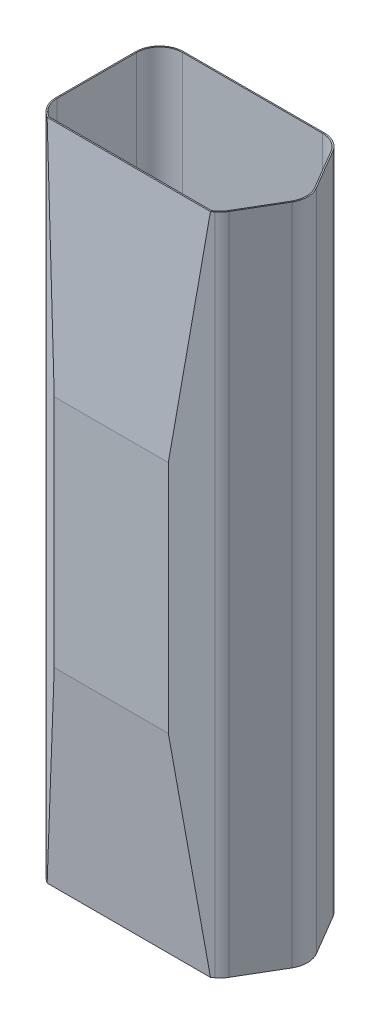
ISO-10303-21;
HEADER;
FILE_DESCRIPTION(('STEP AP214'),'2;1');
FILE_NAME('part.step','',(''),(''),'','','');
FILE_SCHEMA(('AUTOMOTIVE_DESIGN { 1 0 10303 214 1 1 1 1 }'));
ENDSEC;
DATA;
#1=APPLICATION_CONTEXT('core data for automotive mechanical design processes');
#2=APPLICATION_PROTOCOL_DEFINITION('international standard','automotive_design',2000,#1);
#3=PRODUCT_CONTEXT('',#1,'mechanical');
#4=PRODUCT('Part','Part','',(#3));
#5=PRODUCT_RELATED_PRODUCT_CATEGORY('part','',(#4));
#6=PRODUCT_DEFINITION_FORMATION('','',#4);
#7=PRODUCT_DEFINITION_CONTEXT('part definition',#1,'design');
#8=PRODUCT_DEFINITION('design','',#6,#7);
#9=PRODUCT_DEFINITION_SHAPE('','',#8);
#10=(LENGTH_UNIT() NAMED_UNIT(*) SI_UNIT(.MILLI.,.METRE.));
#11=(NAMED_UNIT(*) PLANE_ANGLE_UNIT() SI_UNIT($,.RADIAN.));
#12=(NAMED_UNIT(*) SI_UNIT($,.STERADIAN.) SOLID_ANGLE_UNIT());
#13=UNCERTAINTY_MEASURE_WITH_UNIT(LENGTH_MEASURE(1.E-05),#10,'distance_accuracy_value','');
#14=(GEOMETRIC_REPRESENTATION_CONTEXT(3) GLOBAL_UNCERTAINTY_ASSIGNED_CONTEXT((#13)) GLOBAL_UNIT_ASSIGNED_CONTEXT((#10,
#11,#12)) REPRESENTATION_CONTEXT('',''));
#15=CARTESIAN_POINT('',(0.,0.,0.));
#16=DIRECTION('',(0.,0.,1.));
#17=DIRECTION('',(1.,0.,0.));
#18=AXIS2_PLACEMENT_3D('',#15,#16,#17);
#19=CARTESIAN_POINT('',(133.248853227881,364.319280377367,24.9398189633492));
#20=DIRECTION('',(-0.596268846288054,0.,-0.802784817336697));
#21=DIRECTION('',(-0.802784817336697,0.,0.596268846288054));
#22=AXIS2_PLACEMENT_3D('',#19,#20,#21);
#23=PLANE('',#22);
#24=DIRECTION('',(0.,-1.,0.));
#25=VECTOR('',#24,1.);
#26=CARTESIAN_POINT('',(133.248853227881,364.319280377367,24.9398189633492));
#27=LINE('',#26,#25);
#28=CARTESIAN_POINT('',(133.248853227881,175.549999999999,24.9398189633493));
#29=VERTEX_POINT('',#28);
#30=CARTESIAN_POINT('',(133.248840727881,82.5501076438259,24.9398282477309));
#31=VERTEX_POINT('',#30);
#32=EDGE_CURVE('E426',#29,#31,#27,.T.);
#33=ORIENTED_EDGE('',*,*,#32,.T.);
#34=DIRECTION('',(0.114927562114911,-0.98969939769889,-0.0853625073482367));
#35=VECTOR('',#34,1.);
#36=CARTESIAN_POINT('',(133.248853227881,82.55,24.9398189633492));
#37=LINE('',#36,#35);
#38=CARTESIAN_POINT('',(142.834865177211,0.,17.8198035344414));
#39=VERTEX_POINT('',#38);
#40=EDGE_CURVE('E353',#31,#39,#37,.T.);
#41=ORIENTED_EDGE('',*,*,#40,.T.);
#42=DIRECTION('',(-0.802784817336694,0.,0.596268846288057));
#43=VECTOR('',#42,1.);
#44=CARTESIAN_POINT('',(143.518809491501,0.,17.3118035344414));
#45=LINE('',#44,#43);
#46=CARTESIAN_POINT('',(143.518809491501,0.,17.3118035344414));
#47=VERTEX_POINT('',#46);
#48=EDGE_CURVE('E371',#47,#39,#45,.T.);
#49=ORIENTED_EDGE('',*,*,#48,.F.);
#50=DIRECTION('',(0.802784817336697,0.,-0.596268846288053));
#51=VECTOR('',#50,1.);
#52=CARTESIAN_POINT('',(133.248853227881,0.,24.9398189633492));
#53=LINE('',#52,#51);
#54=CARTESIAN_POINT('',(143.912143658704,0.,17.0196543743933));
#55=VERTEX_POINT('',#54);
#56=EDGE_CURVE('E337',#47,#55,#53,.T.);
#57=ORIENTED_EDGE('',*,*,#56,.T.);
#58=DIRECTION('',(0.,-1.,0.));
#59=VECTOR('',#58,1.);
#60=CARTESIAN_POINT('',(143.912143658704,364.319280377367,17.0196543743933));
#61=LINE('',#60,#59);
#62=CARTESIAN_POINT('',(143.912143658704,263.,17.0196543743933));
#63=VERTEX_POINT('',#62);
#64=EDGE_CURVE('E537',#63,#55,#61,.T.);
#65=ORIENTED_EDGE('',*,*,#64,.F.);
#66=DIRECTION('',(0.802784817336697,0.,-0.596268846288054));
#67=VECTOR('',#66,1.);
#68=CARTESIAN_POINT('',(133.248853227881,263.,24.9398189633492));
#69=LINE('',#68,#67);
#70=CARTESIAN_POINT('',(143.518809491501,263.,17.3118035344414));
#71=VERTEX_POINT('',#70);
#72=EDGE_CURVE('E512',#71,#63,#69,.T.);
#73=ORIENTED_EDGE('',*,*,#72,.F.);
#74=DIRECTION('',(0.802784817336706,0.,-0.596268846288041));
#75=VECTOR('',#74,1.);
#76=CARTESIAN_POINT('',(142.83486517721,263.,17.8198035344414));
#77=LINE('',#76,#75);
#78=CARTESIAN_POINT('',(142.83486517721,263.,17.8198035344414));
#79=VERTEX_POINT('',#78);
#80=EDGE_CURVE('E590',#79,#71,#77,.T.);
#81=ORIENTED_EDGE('',*,*,#80,.F.);
#82=DIRECTION('',(-0.108609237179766,-0.990805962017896,0.0806695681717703));
#83=VECTOR('',#82,1.);
#84=CARTESIAN_POINT('',(142.83486517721,263.,17.8198035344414));
#85=LINE('',#84,#83);
#86=EDGE_CURVE('E443',#79,#29,#85,.T.);
#87=ORIENTED_EDGE('',*,*,#86,.T.);
#88=EDGE_LOOP('',(#33,#41,#49,#57,#65,#73,#81,#87));
#89=FACE_BOUND('',#88,.T.);
#90=ADVANCED_FACE('F86',(#89),#23,.F.);
#91=CARTESIAN_POINT('',(88.0060961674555,364.319280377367,24.9398189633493));
#92=DIRECTION('',(0.,0.,-1.));
#93=DIRECTION('',(-1.,0.,0.));
#94=AXIS2_PLACEMENT_3D('',#91,#92,#93);
#95=PLANE('',#94);
#96=DIRECTION('',(1.,0.,0.));
#97=VECTOR('',#96,1.);
#98=CARTESIAN_POINT('',(0.,82.55,24.9398189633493));
#99=LINE('',#98,#97);
#100=CARTESIAN_POINT('',(88.0061086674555,82.5501038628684,24.9398279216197));
#101=VERTEX_POINT('',#100);
#102=EDGE_CURVE('E429',#31,#101,#99,.F.);
#103=ORIENTED_EDGE('',*,*,#102,.F.);
#104=ORIENTED_EDGE('',*,*,#32,.F.);
#105=DIRECTION('',(1.,0.,0.));
#106=VECTOR('',#105,1.);
#107=CARTESIAN_POINT('',(0.,175.55,24.9398189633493));
#108=LINE('',#107,#106);
#109=CARTESIAN_POINT('',(88.0060961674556,175.55,24.9398189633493));
#110=VERTEX_POINT('',#109);
#111=EDGE_CURVE('E440',#110,#29,#108,.T.);
#112=ORIENTED_EDGE('',*,*,#111,.F.);
#113=DIRECTION('',(0.,-1.,0.));
#114=VECTOR('',#113,1.);
#115=CARTESIAN_POINT('',(88.0060961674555,364.319280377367,24.9398189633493));
#116=LINE('',#115,#114);
#117=EDGE_CURVE('E129',#110,#101,#116,.T.);
#118=ORIENTED_EDGE('',*,*,#117,.T.);
#119=EDGE_LOOP('',(#103,#104,#112,#118));
#120=FACE_BOUND('',#119,.T.);
#121=ADVANCED_FACE('F687',(#120),#95,.F.);
#122=CARTESIAN_POINT('',(77.2179734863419,364.319280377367,17.208385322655));
#123=DIRECTION('',(0.582516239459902,0.,-0.812819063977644));
#124=DIRECTION('',(-0.812819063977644,0.,-0.582516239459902));
#125=AXIS2_PLACEMENT_3D('',#122,#123,#124);
#126=PLANE('',#125);
#127=ORIENTED_EDGE('',*,*,#117,.F.);
#128=DIRECTION('',(0.112513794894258,-0.990373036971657,0.0806343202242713));
#129=VECTOR('',#128,1.);
#130=CARTESIAN_POINT('',(78.0711211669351,263.,17.8198035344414));
#131=LINE('',#130,#129);
#132=CARTESIAN_POINT('',(78.0711211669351,263.,17.8198035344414));
#133=VERTEX_POINT('',#132);
#134=EDGE_CURVE('E365',#133,#110,#131,.T.);
#135=ORIENTED_EDGE('',*,*,#134,.F.);
#136=DIRECTION('',(0.812819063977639,0.,0.58251623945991));
#137=VECTOR('',#136,1.);
#138=CARTESIAN_POINT('',(77.3622789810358,263.,17.3118035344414));
#139=LINE('',#138,#137);
#140=CARTESIAN_POINT('',(77.3622789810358,263.,17.3118035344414));
#141=VERTEX_POINT('',#140);
#142=EDGE_CURVE('E593',#141,#133,#139,.T.);
#143=ORIENTED_EDGE('',*,*,#142,.F.);
#144=DIRECTION('',(0.812819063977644,0.,0.582516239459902));
#145=VECTOR('',#144,1.);
#146=CARTESIAN_POINT('',(77.2179734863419,263.,17.208385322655));
#147=LINE('',#146,#145);
#148=CARTESIAN_POINT('',(77.2179734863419,263.,17.208385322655));
#149=VERTEX_POINT('',#148);
#150=EDGE_CURVE('E870',#149,#141,#147,.T.);
#151=ORIENTED_EDGE('',*,*,#150,.F.);
#152=DIRECTION('',(0.,-1.,0.));
#153=VECTOR('',#152,1.);
#154=CARTESIAN_POINT('',(77.2179734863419,364.319280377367,17.208385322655));
#155=LINE('',#154,#153);
#156=CARTESIAN_POINT('',(77.2179734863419,0.,17.208385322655));
#157=VERTEX_POINT('',#156);
#158=EDGE_CURVE('E333',#149,#157,#155,.T.);
#159=ORIENTED_EDGE('',*,*,#158,.T.);
#160=DIRECTION('',(0.812819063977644,0.,0.582516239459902));
#161=VECTOR('',#160,1.);
#162=CARTESIAN_POINT('',(77.2179734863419,0.,17.208385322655));
#163=LINE('',#162,#161);
#164=CARTESIAN_POINT('',(77.3622789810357,0.,17.3118035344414));
#165=VERTEX_POINT('',#164);
#166=EDGE_CURVE('E325',#157,#165,#163,.T.);
#167=ORIENTED_EDGE('',*,*,#166,.T.);
#168=DIRECTION('',(-0.812819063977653,0.,-0.58251623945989));
#169=VECTOR('',#168,1.);
#170=CARTESIAN_POINT('',(78.0711211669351,0.,17.8198035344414));
#171=LINE('',#170,#169);
#172=CARTESIAN_POINT('',(78.0711211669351,0.,17.8198035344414));
#173=VERTEX_POINT('',#172);
#174=EDGE_CURVE('E330',#173,#165,#171,.T.);
#175=ORIENTED_EDGE('',*,*,#174,.F.);
#176=DIRECTION('',(-0.119053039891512,-0.989215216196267,-0.0853207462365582));
#177=VECTOR('',#176,1.);
#178=CARTESIAN_POINT('',(88.0060961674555,82.55,24.9398189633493));
#179=LINE('',#178,#177);
#180=EDGE_CURVE('E404',#101,#173,#179,.T.);
#181=ORIENTED_EDGE('',*,*,#180,.F.);
#182=EDGE_LOOP('',(#127,#135,#143,#151,#159,#167,#175,#181));
#183=FACE_BOUND('',#182,.T.);
#184=ADVANCED_FACE('F327',(#183),#126,.F.);
#185=CARTESIAN_POINT('',(143.624384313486,364.319280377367,16.6322304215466));
#186=DIRECTION('',(-0.596268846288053,0.,-0.802784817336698));
#187=DIRECTION('',(-0.802784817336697,0.,0.596268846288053));
#188=AXIS2_PLACEMENT_3D('',#185,#186,#187);
#189=PLANE('',#188);
#190=DIRECTION('',(0.000642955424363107,-0.99999979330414,0.));
#191=VECTOR('',#190,1.);
#192=CARTESIAN_POINT('',(142.735981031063,41.275,17.3118035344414));
#193=LINE('',#192,#191);
#194=CARTESIAN_POINT('',(142.686643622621,82.55,17.3287378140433));
#195=VERTEX_POINT('',#194);
#196=CARTESIAN_POINT('',(142.744256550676,2.14143449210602E-11,17.3002564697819));
#197=VERTEX_POINT('',#196);
#198=EDGE_CURVE('E300',#195,#197,#193,.T.);
#199=ORIENTED_EDGE('',*,*,#198,.F.);
#200=DIRECTION('',(-0.802784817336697,0.,0.596268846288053));
#201=VECTOR('',#200,1.);
#202=CARTESIAN_POINT('',(143.624384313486,82.55,16.6322304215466));
#203=LINE('',#202,#201);
#204=CARTESIAN_POINT('',(133.123431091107,82.55,24.4318189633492));
#205=VERTEX_POINT('',#204);
#206=EDGE_CURVE('E136',#195,#205,#203,.T.);
#207=ORIENTED_EDGE('',*,*,#206,.T.);
#208=DIRECTION('',(0.,-1.,0.));
#209=VECTOR('',#208,1.);
#210=CARTESIAN_POINT('',(133.123431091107,364.319280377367,24.4318189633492));
#211=LINE('',#210,#209);
#212=CARTESIAN_POINT('',(133.123431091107,175.549999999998,24.4318189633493));
#213=VERTEX_POINT('',#212);
#214=EDGE_CURVE('E545',#213,#205,#211,.T.);
#215=ORIENTED_EDGE('',*,*,#214,.F.);
#216=DIRECTION('',(-0.802784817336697,0.,0.596268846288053));
#217=VECTOR('',#216,1.);
#218=CARTESIAN_POINT('',(143.624384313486,175.55,16.6322304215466));
#219=LINE('',#218,#217);
#220=CARTESIAN_POINT('',(142.686643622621,175.55,17.3287378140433));
#221=VERTEX_POINT('',#220);
#222=EDGE_CURVE('E454',#213,#221,#219,.F.);
#223=ORIENTED_EDGE('',*,*,#222,.T.);
#224=DIRECTION('',(-0.000606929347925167,-0.999999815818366,0.));
#225=VECTOR('',#224,1.);
#226=CARTESIAN_POINT('',(142.735981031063,219.275,17.3118035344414));
#227=LINE('',#226,#225);
#228=CARTESIAN_POINT('',(142.734544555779,263.,17.2991004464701));
#229=VERTEX_POINT('',#228);
#230=EDGE_CURVE('E445',#229,#221,#227,.T.);
#231=ORIENTED_EDGE('',*,*,#230,.F.);
#232=DIRECTION('',(0.802784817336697,0.,-0.596268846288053));
#233=VECTOR('',#232,1.);
#234=CARTESIAN_POINT('',(143.624384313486,263.,16.6322304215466));
#235=LINE('',#234,#233);
#236=CARTESIAN_POINT('',(143.624384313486,263.,16.6322304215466));
#237=VERTEX_POINT('',#236);
#238=EDGE_CURVE('E844',#229,#237,#235,.T.);
#239=ORIENTED_EDGE('',*,*,#238,.T.);
#240=DIRECTION('',(0.,-1.,0.));
#241=VECTOR('',#240,1.);
#242=CARTESIAN_POINT('',(143.624384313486,364.319280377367,16.6322304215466));
#243=LINE('',#242,#241);
#244=CARTESIAN_POINT('',(143.624384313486,0.,16.6322304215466));
#245=VERTEX_POINT('',#244);
#246=EDGE_CURVE('E548',#237,#245,#243,.T.);
#247=ORIENTED_EDGE('',*,*,#246,.T.);
#248=DIRECTION('',(0.802784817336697,0.,-0.596268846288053));
#249=VECTOR('',#248,1.);
#250=CARTESIAN_POINT('',(143.624384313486,0.,16.6322304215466));
#251=LINE('',#250,#249);
#252=EDGE_CURVE('E108',#197,#245,#251,.T.);
#253=ORIENTED_EDGE('',*,*,#252,.F.);
#254=EDGE_LOOP('',(#199,#207,#215,#223,#231,#239,#247,#253));
#255=FACE_BOUND('',#254,.T.);
#256=ADVANCED_FACE('F514',(#255),#189,.T.);
#257=CARTESIAN_POINT('',(88.1234310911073,364.319280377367,24.4318189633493));
#258=DIRECTION('',(0.,0.,-1.));
#259=DIRECTION('',(-1.,0.,0.));
#260=AXIS2_PLACEMENT_3D('',#257,#258,#259);
#261=PLANE('',#260);
#262=ORIENTED_EDGE('',*,*,#214,.T.);
#263=DIRECTION('',(-1.,0.,0.));
#264=VECTOR('',#263,1.);
#265=CARTESIAN_POINT('',(88.1234310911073,82.55,24.4318189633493));
#266=LINE('',#265,#264);
#267=CARTESIAN_POINT('',(88.1234310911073,82.55,24.4318189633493));
#268=VERTEX_POINT('',#267);
#269=EDGE_CURVE('E392',#205,#268,#266,.T.);
#270=ORIENTED_EDGE('',*,*,#269,.T.);
#271=DIRECTION('',(0.,-1.,0.));
#272=VECTOR('',#271,1.);
#273=CARTESIAN_POINT('',(88.1234310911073,364.319280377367,24.4318189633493));
#274=LINE('',#273,#272);
#275=CARTESIAN_POINT('',(88.1234310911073,175.550000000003,24.4318189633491));
#276=VERTEX_POINT('',#275);
#277=EDGE_CURVE('E547',#276,#268,#274,.T.);
#278=ORIENTED_EDGE('',*,*,#277,.F.);
#279=DIRECTION('',(-1.,0.,0.));
#280=VECTOR('',#279,1.);
#281=CARTESIAN_POINT('',(88.1234310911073,175.55,24.4318189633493));
#282=LINE('',#281,#280);
#283=EDGE_CURVE('E459',#276,#213,#282,.F.);
#284=ORIENTED_EDGE('',*,*,#283,.T.);
#285=EDGE_LOOP('',(#262,#270,#278,#284));
#286=FACE_BOUND('',#285,.T.);
#287=ADVANCED_FACE('F490',(#286),#261,.T.);
#288=CARTESIAN_POINT('',(77.3679704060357,364.319280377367,16.7237929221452));
#289=DIRECTION('',(0.582516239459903,0.,-0.812819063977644));
#290=DIRECTION('',(-0.812819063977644,0.,-0.582516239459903));
#291=AXIS2_PLACEMENT_3D('',#288,#289,#290);
#292=PLANE('',#291);
#293=DIRECTION('',(-0.000656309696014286,-0.999999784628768,0.));
#294=VECTOR('',#293,1.);
#295=CARTESIAN_POINT('',(78.1884560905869,82.55,17.3118035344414));
#296=LINE('',#295,#294);
#297=CARTESIAN_POINT('',(78.2120199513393,82.55,17.3286908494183));
#298=VERTEX_POINT('',#297);
#299=CARTESIAN_POINT('',(78.1457726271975,0.,17.303317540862));
#300=VERTEX_POINT('',#299);
#301=EDGE_CURVE('E362',#298,#300,#296,.T.);
#302=ORIENTED_EDGE('',*,*,#301,.T.);
#303=DIRECTION('',(0.812819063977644,0.,0.582516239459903));
#304=VECTOR('',#303,1.);
#305=CARTESIAN_POINT('',(77.3679704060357,0.,16.7237929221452));
#306=LINE('',#305,#304);
#307=CARTESIAN_POINT('',(77.3679704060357,0.,16.7237929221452));
#308=VERTEX_POINT('',#307);
#309=EDGE_CURVE('E467',#308,#300,#306,.T.);
#310=ORIENTED_EDGE('',*,*,#309,.F.);
#311=DIRECTION('',(0.,-1.,0.));
#312=VECTOR('',#311,1.);
#313=CARTESIAN_POINT('',(77.3679704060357,364.319280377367,16.7237929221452));
#314=LINE('',#313,#312);
#315=CARTESIAN_POINT('',(77.3679704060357,263.,16.7237929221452));
#316=VERTEX_POINT('',#315);
#317=EDGE_CURVE('E552',#316,#308,#314,.T.);
#318=ORIENTED_EDGE('',*,*,#317,.F.);
#319=DIRECTION('',(0.812819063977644,0.,0.582516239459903));
#320=VECTOR('',#319,1.);
#321=CARTESIAN_POINT('',(77.3679704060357,263.,16.7237929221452));
#322=LINE('',#321,#320);
#323=CARTESIAN_POINT('',(78.1613669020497,263.,17.3118035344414));
#324=VERTEX_POINT('',#323);
#325=EDGE_CURVE('E847',#316,#324,#322,.T.);
#326=ORIENTED_EDGE('',*,*,#325,.T.);
#327=DIRECTION('',(0.000619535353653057,-0.999999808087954,0.));
#328=VECTOR('',#327,1.);
#329=CARTESIAN_POINT('',(78.1342777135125,263.,17.3118035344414));
#330=LINE('',#329,#328);
#331=CARTESIAN_POINT('',(78.2120199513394,175.55,17.3286908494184));
#332=VERTEX_POINT('',#331);
#333=EDGE_CURVE('E591',#324,#332,#330,.T.);
#334=ORIENTED_EDGE('',*,*,#333,.T.);
#335=DIRECTION('',(-0.812819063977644,0.,-0.582516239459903));
#336=VECTOR('',#335,1.);
#337=CARTESIAN_POINT('',(77.3679704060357,175.55,16.7237929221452));
#338=LINE('',#337,#336);
#339=EDGE_CURVE('E96',#332,#276,#338,.F.);
#340=ORIENTED_EDGE('',*,*,#339,.T.);
#341=ORIENTED_EDGE('',*,*,#277,.T.);
#342=DIRECTION('',(-0.812819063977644,0.,-0.582516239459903));
#343=VECTOR('',#342,1.);
#344=CARTESIAN_POINT('',(77.3679704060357,82.55,16.7237929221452));
#345=LINE('',#344,#343);
#346=EDGE_CURVE('E14',#268,#298,#345,.T.);
#347=ORIENTED_EDGE('',*,*,#346,.T.);
#348=EDGE_LOOP('',(#302,#310,#318,#326,#334,#340,#341,#347));
#349=FACE_BOUND('',#348,.T.);
#350=ADVANCED_FACE('F480',(#349),#292,.T.);
#351=CARTESIAN_POINT('',(147.433431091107,0.,-6.42531375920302));
#352=DIRECTION('',(0.,1.,0.));
#353=DIRECTION('',(0.,0.,1.));
#354=AXIS2_PLACEMENT_3D('',#351,#352,#353);
#355=PLANE('',#354);
#356=ORIENTED_EDGE('',*,*,#309,.T.);
#357=DIRECTION('',(1.,0.,0.));
#358=VECTOR('',#357,1.);
#359=CARTESIAN_POINT('',(77.3622789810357,0.,17.3118035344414));
#360=LINE('',#359,#358);
#361=CARTESIAN_POINT('',(89.55559842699,0.,17.3118035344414));
#362=VERTEX_POINT('',#361);
#363=EDGE_CURVE('E369',#300,#362,#360,.T.);
#364=ORIENTED_EDGE('',*,*,#363,.T.);
#365=CARTESIAN_POINT('',(131.604624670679,0.,17.3118035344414));
#366=VERTEX_POINT('',#365);
#367=EDGE_CURVE('E347',#362,#366,#360,.T.);
#368=ORIENTED_EDGE('',*,*,#367,.T.);
#369=EDGE_CURVE('E345',#366,#197,#360,.T.);
#370=ORIENTED_EDGE('',*,*,#369,.T.);
#371=ORIENTED_EDGE('',*,*,#252,.T.);
#372=CARTESIAN_POINT('',(138.183431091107,0.,9.30681896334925));
#373=DIRECTION('',(0.,1.,0.));
#374=DIRECTION('',(0.,0.,-1.));
#375=AXIS2_PLACEMENT_3D('',#372,#373,#374);
#376=CIRCLE('',#375,9.12499999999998);
#377=CARTESIAN_POINT('',(146.049497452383,0.,13.9318189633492));
#378=VERTEX_POINT('',#377);
#379=EDGE_CURVE('E466',#245,#378,#376,.T.);
#380=ORIENTED_EDGE('',*,*,#379,.T.);
#381=DIRECTION('',(0.506849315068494,0.,-0.862034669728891));
#382=VECTOR('',#381,1.);
#383=CARTESIAN_POINT('',(155.299497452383,0.,-1.80031375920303));
#384=LINE('',#383,#382);
#385=CARTESIAN_POINT('',(155.299497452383,0.,-1.80031375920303));
#386=VERTEX_POINT('',#385);
#387=EDGE_CURVE('E757',#378,#386,#384,.T.);
#388=ORIENTED_EDGE('',*,*,#387,.T.);
#389=CARTESIAN_POINT('',(147.433431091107,0.,-6.42531375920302));
#390=DIRECTION('',(0.,1.,0.));
#391=DIRECTION('',(0.,0.,1.));
#392=AXIS2_PLACEMENT_3D('',#389,#390,#391);
#393=CIRCLE('',#392,9.12499999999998);
#394=CARTESIAN_POINT('',(155.299497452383,0.,-11.050313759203));
#395=VERTEX_POINT('',#394);
#396=EDGE_CURVE('E761',#386,#395,#393,.T.);
#397=ORIENTED_EDGE('',*,*,#396,.T.);
#398=DIRECTION('',(-0.506849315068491,0.,-0.862034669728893));
#399=VECTOR('',#398,1.);
#400=CARTESIAN_POINT('',(155.299497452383,0.,-11.050313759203));
#401=LINE('',#400,#399);
#402=CARTESIAN_POINT('',(146.049497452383,0.,-26.7824464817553));
#403=VERTEX_POINT('',#402);
#404=EDGE_CURVE('E765',#395,#403,#401,.T.);
#405=ORIENTED_EDGE('',*,*,#404,.T.);
#406=CARTESIAN_POINT('',(138.183431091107,0.,-22.1574464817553));
#407=DIRECTION('',(0.,1.,0.));
#408=DIRECTION('',(0.,0.,-1.));
#409=AXIS2_PLACEMENT_3D('',#406,#407,#408);
#410=CIRCLE('',#409,9.125);
#411=CARTESIAN_POINT('',(138.183431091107,0.,-31.2824464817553));
#412=VERTEX_POINT('',#411);
#413=EDGE_CURVE('E769',#403,#412,#410,.T.);
#414=ORIENTED_EDGE('',*,*,#413,.T.);
#415=DIRECTION('',(-1.,0.,0.));
#416=VECTOR('',#415,1.);
#417=CARTESIAN_POINT('',(138.183431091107,0.,-31.2824464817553));
#418=LINE('',#417,#416);
#419=CARTESIAN_POINT('',(82.6834310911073,0.,-31.2824464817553));
#420=VERTEX_POINT('',#419);
#421=EDGE_CURVE('E772',#412,#420,#418,.T.);
#422=ORIENTED_EDGE('',*,*,#421,.T.);
#423=CARTESIAN_POINT('',(82.6834310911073,0.,-22.1574464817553));
#424=DIRECTION('',(0.,1.,0.));
#425=DIRECTION('',(0.,0.,1.));
#426=AXIS2_PLACEMENT_3D('',#423,#424,#425);
#427=CIRCLE('',#426,9.12499999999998);
#428=CARTESIAN_POINT('',(73.5584310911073,0.,-22.1574464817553));
#429=VERTEX_POINT('',#428);
#430=EDGE_CURVE('E775',#420,#429,#427,.T.);
#431=ORIENTED_EDGE('',*,*,#430,.T.);
#432=DIRECTION('',(0.,0.,1.));
#433=VECTOR('',#432,1.);
#434=CARTESIAN_POINT('',(73.5584310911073,0.,-22.1574464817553));
#435=LINE('',#434,#433);
#436=CARTESIAN_POINT('',(73.5584310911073,0.,9.30681896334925));
#437=VERTEX_POINT('',#436);
#438=EDGE_CURVE('E778',#429,#437,#435,.T.);
#439=ORIENTED_EDGE('',*,*,#438,.T.);
#440=CARTESIAN_POINT('',(82.6834310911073,0.,9.30681896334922));
#441=DIRECTION('',(0.,1.,0.));
#442=DIRECTION('',(0.,0.,1.));
#443=AXIS2_PLACEMENT_3D('',#440,#441,#442);
#444=CIRCLE('',#443,9.12499999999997);
#445=EDGE_CURVE('E471',#437,#308,#444,.T.);
#446=ORIENTED_EDGE('',*,*,#445,.T.);
#447=EDGE_LOOP('',(#356,#364,#368,#370,#371,#380,#388,#397,#405,#414,#422,#431,#439,#446));
#448=FACE_BOUND('',#447,.T.);
#449=ORIENTED_EDGE('',*,*,#174,.T.);
#450=ORIENTED_EDGE('',*,*,#166,.F.);
#451=CARTESIAN_POINT('',(82.6834310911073,0.,9.30681896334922));
#452=DIRECTION('',(0.,1.,0.));
#453=DIRECTION('',(0.,0.,1.));
#454=AXIS2_PLACEMENT_3D('',#451,#452,#453);
#455=CIRCLE('',#454,9.60759999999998);
#456=CARTESIAN_POINT('',(73.0758310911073,0.,9.30681896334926));
#457=VERTEX_POINT('',#456);
#458=EDGE_CURVE('E338',#457,#157,#455,.T.);
#459=ORIENTED_EDGE('',*,*,#458,.F.);
#460=DIRECTION('',(0.,0.,1.));
#461=VECTOR('',#460,1.);
#462=CARTESIAN_POINT('',(73.0758310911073,0.,-22.1574464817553));
#463=LINE('',#462,#461);
#464=CARTESIAN_POINT('',(73.0758310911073,0.,-22.1574464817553));
#465=VERTEX_POINT('',#464);
#466=EDGE_CURVE('E816',#465,#457,#463,.T.);
#467=ORIENTED_EDGE('',*,*,#466,.F.);
#468=CARTESIAN_POINT('',(82.6834310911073,0.,-22.1574464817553));
#469=DIRECTION('',(0.,1.,0.));
#470=DIRECTION('',(0.,0.,1.));
#471=AXIS2_PLACEMENT_3D('',#468,#469,#470);
#472=CIRCLE('',#471,9.60759999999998);
#473=CARTESIAN_POINT('',(82.7502388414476,0.,-31.7648142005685));
#474=VERTEX_POINT('',#473);
#475=EDGE_CURVE('E813',#474,#465,#472,.T.);
#476=ORIENTED_EDGE('',*,*,#475,.F.);
#477=DIRECTION('',(-1.,0.,0.));
#478=VECTOR('',#477,1.);
#479=CARTESIAN_POINT('',(82.7502388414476,0.,-31.7648142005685));
#480=LINE('',#479,#478);
#481=CARTESIAN_POINT('',(138.434122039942,0.,-31.7648142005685));
#482=VERTEX_POINT('',#481);
#483=EDGE_CURVE('E810',#482,#474,#480,.T.);
#484=ORIENTED_EDGE('',*,*,#483,.F.);
#485=CARTESIAN_POINT('',(138.434122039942,0.,-22.5992813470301));
#486=DIRECTION('',(0.,1.,0.));
#487=DIRECTION('',(0.,0.,1.));
#488=AXIS2_PLACEMENT_3D('',#485,#486,#487);
#489=CIRCLE('',#488,9.16553285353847);
#490=CARTESIAN_POINT('',(146.335129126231,0.,-27.2448253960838));
#491=VERTEX_POINT('',#490);
#492=EDGE_CURVE('E807',#491,#482,#489,.T.);
#493=ORIENTED_EDGE('',*,*,#492,.F.);
#494=DIRECTION('',(-0.506849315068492,0.,-0.862034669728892));
#495=VECTOR('',#494,1.);
#496=CARTESIAN_POINT('',(155.613944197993,0.,-11.463684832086));
#497=LINE('',#496,#495);
#498=CARTESIAN_POINT('',(155.613944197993,0.,-11.463684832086));
#499=VERTEX_POINT('',#498);
#500=EDGE_CURVE('E804',#499,#491,#497,.T.);
#501=ORIENTED_EDGE('',*,*,#500,.F.);
#502=CARTESIAN_POINT('',(147.433431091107,0.,-6.42531375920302));
#503=DIRECTION('',(0.,1.,0.));
#504=DIRECTION('',(0.,0.,1.));
#505=AXIS2_PLACEMENT_3D('',#502,#503,#504);
#506=CIRCLE('',#505,9.60759999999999);
#507=CARTESIAN_POINT('',(155.715515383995,0.,-1.55570827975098));
#508=VERTEX_POINT('',#507);
#509=EDGE_CURVE('E743',#508,#499,#506,.T.);
#510=ORIENTED_EDGE('',*,*,#509,.F.);
#511=DIRECTION('',(0.506849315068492,0.,-0.862034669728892));
#512=VECTOR('',#511,1.);
#513=CARTESIAN_POINT('',(155.715515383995,0.,-1.55570827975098));
#514=LINE('',#513,#512);
#515=CARTESIAN_POINT('',(146.465515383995,0.,14.1764244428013));
#516=VERTEX_POINT('',#515);
#517=EDGE_CURVE('E822',#516,#508,#514,.T.);
#518=ORIENTED_EDGE('',*,*,#517,.F.);
#519=CARTESIAN_POINT('',(138.183431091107,0.,9.30681896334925));
#520=DIRECTION('',(0.,1.,0.));
#521=DIRECTION('',(0.,0.,-1.));
#522=AXIS2_PLACEMENT_3D('',#519,#520,#521);
#523=CIRCLE('',#522,9.60759999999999);
#524=EDGE_CURVE('E542',#55,#516,#523,.T.);
#525=ORIENTED_EDGE('',*,*,#524,.F.);
#526=ORIENTED_EDGE('',*,*,#56,.F.);
#527=ORIENTED_EDGE('',*,*,#48,.T.);
#528=DIRECTION('',(-1.,0.,0.));
#529=VECTOR('',#528,1.);
#530=CARTESIAN_POINT('',(142.834865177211,0.,17.8198035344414));
#531=LINE('',#530,#529);
#532=EDGE_CURVE('E344',#39,#173,#531,.T.);
#533=ORIENTED_EDGE('',*,*,#532,.T.);
#534=EDGE_LOOP('',(#449,#450,#459,#467,#476,#484,#493,#501,#510,#518,#525,#526,#527,#533));
#535=FACE_BOUND('',#534,.T.);
#536=ADVANCED_FACE('F341',(#448,#535),#355,.F.);
#537=CARTESIAN_POINT('',(0.,263.,0.));
#538=DIRECTION('',(0.,1.,0.));
#539=DIRECTION('',(0.,0.,1.));
#540=AXIS2_PLACEMENT_3D('',#537,#538,#539);
#541=PLANE('',#540);
#542=DIRECTION('',(-1.,0.,0.));
#543=VECTOR('',#542,1.);
#544=CARTESIAN_POINT('',(77.3622789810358,263.,17.3118035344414));
#545=LINE('',#544,#543);
#546=CARTESIAN_POINT('',(89.55559842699,263.,17.3118035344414));
#547=VERTEX_POINT('',#546);
#548=EDGE_CURVE('E573',#547,#324,#545,.T.);
#549=ORIENTED_EDGE('',*,*,#548,.T.);
#550=ORIENTED_EDGE('',*,*,#325,.F.);
#551=CARTESIAN_POINT('',(82.6834310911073,263.,9.30681896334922));
#552=DIRECTION('',(0.,1.,0.));
#553=DIRECTION('',(0.,0.,1.));
#554=AXIS2_PLACEMENT_3D('',#551,#552,#553);
#555=CIRCLE('',#554,9.12499999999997);
#556=CARTESIAN_POINT('',(73.5584310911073,263.,9.30681896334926));
#557=VERTEX_POINT('',#556);
#558=EDGE_CURVE('E851',#557,#316,#555,.T.);
#559=ORIENTED_EDGE('',*,*,#558,.F.);
#560=DIRECTION('',(0.,0.,1.));
#561=VECTOR('',#560,1.);
#562=CARTESIAN_POINT('',(73.5584310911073,263.,-22.1574464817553));
#563=LINE('',#562,#561);
#564=CARTESIAN_POINT('',(73.5584310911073,263.,-22.1574464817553));
#565=VERTEX_POINT('',#564);
#566=EDGE_CURVE('E456',#565,#557,#563,.T.);
#567=ORIENTED_EDGE('',*,*,#566,.F.);
#568=CARTESIAN_POINT('',(82.6834310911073,263.,-22.1574464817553));
#569=DIRECTION('',(0.,1.,0.));
#570=DIRECTION('',(0.,0.,1.));
#571=AXIS2_PLACEMENT_3D('',#568,#569,#570);
#572=CIRCLE('',#571,9.12499999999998);
#573=CARTESIAN_POINT('',(82.6834310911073,263.,-31.2824464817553));
#574=VERTEX_POINT('',#573);
#575=EDGE_CURVE('E453',#574,#565,#572,.T.);
#576=ORIENTED_EDGE('',*,*,#575,.F.);
#577=DIRECTION('',(-1.,0.,0.));
#578=VECTOR('',#577,1.);
#579=CARTESIAN_POINT('',(138.183431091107,263.,-31.2824464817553));
#580=LINE('',#579,#578);
#581=CARTESIAN_POINT('',(138.183431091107,263.,-31.2824464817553));
#582=VERTEX_POINT('',#581);
#583=EDGE_CURVE('E988',#582,#574,#580,.T.);
#584=ORIENTED_EDGE('',*,*,#583,.F.);
#585=CARTESIAN_POINT('',(138.183431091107,263.,-22.1574464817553));
#586=DIRECTION('',(0.,1.,0.));
#587=DIRECTION('',(0.,0.,1.));
#588=AXIS2_PLACEMENT_3D('',#585,#586,#587);
#589=CIRCLE('',#588,9.125);
#590=CARTESIAN_POINT('',(146.049497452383,263.,-26.7824464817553));
#591=VERTEX_POINT('',#590);
#592=EDGE_CURVE('E989',#591,#582,#589,.T.);
#593=ORIENTED_EDGE('',*,*,#592,.F.);
#594=DIRECTION('',(-0.506849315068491,0.,-0.862034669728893));
#595=VECTOR('',#594,1.);
#596=CARTESIAN_POINT('',(155.299497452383,263.,-11.050313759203));
#597=LINE('',#596,#595);
#598=CARTESIAN_POINT('',(155.299497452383,263.,-11.050313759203));
#599=VERTEX_POINT('',#598);
#600=EDGE_CURVE('E992',#599,#591,#597,.T.);
#601=ORIENTED_EDGE('',*,*,#600,.F.);
#602=CARTESIAN_POINT('',(147.433431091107,263.,-6.42531375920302));
#603=DIRECTION('',(0.,1.,0.));
#604=DIRECTION('',(0.,0.,1.));
#605=AXIS2_PLACEMENT_3D('',#602,#603,#604);
#606=CIRCLE('',#605,9.12499999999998);
#607=CARTESIAN_POINT('',(155.299497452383,263.,-1.80031375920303));
#608=VERTEX_POINT('',#607);
#609=EDGE_CURVE('E997',#608,#599,#606,.T.);
#610=ORIENTED_EDGE('',*,*,#609,.F.);
#611=DIRECTION('',(0.506849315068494,0.,-0.862034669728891));
#612=VECTOR('',#611,1.);
#613=CARTESIAN_POINT('',(155.299497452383,263.,-1.80031375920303));
#614=LINE('',#613,#612);
#615=CARTESIAN_POINT('',(146.049497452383,263.,13.9318189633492));
#616=VERTEX_POINT('',#615);
#617=EDGE_CURVE('E999',#616,#608,#614,.T.);
#618=ORIENTED_EDGE('',*,*,#617,.F.);
#619=CARTESIAN_POINT('',(138.183431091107,263.,9.30681896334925));
#620=DIRECTION('',(0.,1.,0.));
#621=DIRECTION('',(0.,0.,1.));
#622=AXIS2_PLACEMENT_3D('',#619,#620,#621);
#623=CIRCLE('',#622,9.12499999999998);
#624=EDGE_CURVE('E848',#237,#616,#623,.T.);
#625=ORIENTED_EDGE('',*,*,#624,.F.);
#626=ORIENTED_EDGE('',*,*,#238,.F.);
#627=CARTESIAN_POINT('',(131.604624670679,263.,17.3118035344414));
#628=VERTEX_POINT('',#627);
#629=EDGE_CURVE('E562',#229,#628,#545,.T.);
#630=ORIENTED_EDGE('',*,*,#629,.T.);
#631=EDGE_CURVE('E309',#628,#547,#545,.T.);
#632=ORIENTED_EDGE('',*,*,#631,.T.);
#633=EDGE_LOOP('',(#549,#550,#559,#567,#576,#584,#593,#601,#610,#618,#625,#626,#630,#632));
#634=FACE_BOUND('',#633,.T.);
#635=ORIENTED_EDGE('',*,*,#150,.T.);
#636=ORIENTED_EDGE('',*,*,#142,.T.);
#637=DIRECTION('',(1.,0.,0.));
#638=VECTOR('',#637,1.);
#639=CARTESIAN_POINT('',(78.0711211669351,263.,17.8198035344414));
#640=LINE('',#639,#638);
#641=EDGE_CURVE('E442',#133,#79,#640,.T.);
#642=ORIENTED_EDGE('',*,*,#641,.T.);
#643=ORIENTED_EDGE('',*,*,#80,.T.);
#644=ORIENTED_EDGE('',*,*,#72,.T.);
#645=CARTESIAN_POINT('',(138.183431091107,263.,9.30681896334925));
#646=DIRECTION('',(0.,1.,0.));
#647=DIRECTION('',(0.,0.,1.));
#648=AXIS2_PLACEMENT_3D('',#645,#646,#647);
#649=CIRCLE('',#648,9.60759999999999);
#650=CARTESIAN_POINT('',(146.465515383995,263.,14.1764244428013));
#651=VERTEX_POINT('',#650);
#652=EDGE_CURVE('E859',#63,#651,#649,.T.);
#653=ORIENTED_EDGE('',*,*,#652,.T.);
#654=DIRECTION('',(0.506849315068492,0.,-0.862034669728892));
#655=VECTOR('',#654,1.);
#656=CARTESIAN_POINT('',(155.715515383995,263.,-1.55570827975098));
#657=LINE('',#656,#655);
#658=CARTESIAN_POINT('',(155.715515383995,263.,-1.55570827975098));
#659=VERTEX_POINT('',#658);
#660=EDGE_CURVE('E748',#651,#659,#657,.T.);
#661=ORIENTED_EDGE('',*,*,#660,.T.);
#662=CARTESIAN_POINT('',(147.433431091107,263.,-6.42531375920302));
#663=DIRECTION('',(0.,1.,0.));
#664=DIRECTION('',(0.,0.,1.));
#665=AXIS2_PLACEMENT_3D('',#662,#663,#664);
#666=CIRCLE('',#665,9.60759999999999);
#667=CARTESIAN_POINT('',(155.613944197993,263.,-11.463684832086));
#668=VERTEX_POINT('',#667);
#669=EDGE_CURVE('E736',#659,#668,#666,.T.);
#670=ORIENTED_EDGE('',*,*,#669,.T.);
#671=DIRECTION('',(-0.506849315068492,0.,-0.862034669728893));
#672=VECTOR('',#671,1.);
#673=CARTESIAN_POINT('',(155.613944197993,263.,-11.463684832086));
#674=LINE('',#673,#672);
#675=CARTESIAN_POINT('',(146.335129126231,263.,-27.2448253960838));
#676=VERTEX_POINT('',#675);
#677=EDGE_CURVE('E727',#668,#676,#674,.T.);
#678=ORIENTED_EDGE('',*,*,#677,.T.);
#679=CARTESIAN_POINT('',(138.434122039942,263.,-22.5992813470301));
#680=DIRECTION('',(0.,1.,0.));
#681=DIRECTION('',(0.,0.,1.));
#682=AXIS2_PLACEMENT_3D('',#679,#680,#681);
#683=CIRCLE('',#682,9.16553285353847);
#684=CARTESIAN_POINT('',(138.434122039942,263.,-31.7648142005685));
#685=VERTEX_POINT('',#684);
#686=EDGE_CURVE('E737',#676,#685,#683,.T.);
#687=ORIENTED_EDGE('',*,*,#686,.T.);
#688=DIRECTION('',(-1.,0.,0.));
#689=VECTOR('',#688,1.);
#690=CARTESIAN_POINT('',(82.7502388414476,263.,-31.7648142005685));
#691=LINE('',#690,#689);
#692=CARTESIAN_POINT('',(82.7502388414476,263.,-31.7648142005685));
#693=VERTEX_POINT('',#692);
#694=EDGE_CURVE('E876',#685,#693,#691,.T.);
#695=ORIENTED_EDGE('',*,*,#694,.T.);
#696=CARTESIAN_POINT('',(82.6834310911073,263.,-22.1574464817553));
#697=DIRECTION('',(0.,1.,0.));
#698=DIRECTION('',(0.,0.,1.));
#699=AXIS2_PLACEMENT_3D('',#696,#697,#698);
#700=CIRCLE('',#699,9.60759999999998);
#701=CARTESIAN_POINT('',(73.0758310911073,263.,-22.1574464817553));
#702=VERTEX_POINT('',#701);
#703=EDGE_CURVE('E873',#693,#702,#700,.T.);
#704=ORIENTED_EDGE('',*,*,#703,.T.);
#705=DIRECTION('',(0.,0.,1.));
#706=VECTOR('',#705,1.);
#707=CARTESIAN_POINT('',(73.0758310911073,263.,-22.1574464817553));
#708=LINE('',#707,#706);
#709=CARTESIAN_POINT('',(73.0758310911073,263.,9.30681896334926));
#710=VERTEX_POINT('',#709);
#711=EDGE_CURVE('E869',#702,#710,#708,.T.);
#712=ORIENTED_EDGE('',*,*,#711,.T.);
#713=CARTESIAN_POINT('',(82.6834310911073,263.,9.30681896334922));
#714=DIRECTION('',(0.,1.,0.));
#715=DIRECTION('',(0.,0.,1.));
#716=AXIS2_PLACEMENT_3D('',#713,#714,#715);
#717=CIRCLE('',#716,9.60759999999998);
#718=EDGE_CURVE('E866',#710,#149,#717,.T.);
#719=ORIENTED_EDGE('',*,*,#718,.T.);
#720=EDGE_LOOP('',(#635,#636,#642,#643,#644,#653,#661,#670,#678,#687,#695,#704,#712,#719));
#721=FACE_BOUND('',#720,.T.);
#722=ADVANCED_FACE('F651',(#634,#721),#541,.T.);
#723=CARTESIAN_POINT('',(155.715515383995,364.319280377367,-1.55570827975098));
#724=DIRECTION('',(-0.862034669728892,0.,-0.506849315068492));
#725=DIRECTION('',(-0.506849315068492,0.,0.862034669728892));
#726=AXIS2_PLACEMENT_3D('',#723,#724,#725);
#727=PLANE('',#726);
#728=ORIENTED_EDGE('',*,*,#660,.F.);
#729=DIRECTION('',(0.,-1.,0.));
#730=VECTOR('',#729,1.);
#731=CARTESIAN_POINT('',(146.465515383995,364.319280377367,14.1764244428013));
#732=LINE('',#731,#730);
#733=EDGE_CURVE('E828',#651,#516,#732,.T.);
#734=ORIENTED_EDGE('',*,*,#733,.T.);
#735=ORIENTED_EDGE('',*,*,#517,.T.);
#736=DIRECTION('',(0.,-1.,0.));
#737=VECTOR('',#736,1.);
#738=CARTESIAN_POINT('',(155.715515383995,364.319280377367,-1.55570827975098));
#739=LINE('',#738,#737);
#740=EDGE_CURVE('E826',#659,#508,#739,.T.);
#741=ORIENTED_EDGE('',*,*,#740,.F.);
#742=EDGE_LOOP('',(#728,#734,#735,#741));
#743=FACE_BOUND('',#742,.T.);
#744=ADVANCED_FACE('F654',(#743),#727,.F.);
#745=CARTESIAN_POINT('',(138.183431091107,364.319280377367,9.30681896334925));
#746=DIRECTION('',(0.,-1.,0.));
#747=DIRECTION('',(0.,0.,-1.));
#748=AXIS2_PLACEMENT_3D('',#745,#746,#747);
#749=CYLINDRICAL_SURFACE('',#748,9.60759999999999);
#750=ORIENTED_EDGE('',*,*,#652,.F.);
#751=ORIENTED_EDGE('',*,*,#64,.T.);
#752=ORIENTED_EDGE('',*,*,#524,.T.);
#753=ORIENTED_EDGE('',*,*,#733,.F.);
#754=EDGE_LOOP('',(#750,#751,#752,#753));
#755=FACE_BOUND('',#754,.T.);
#756=ADVANCED_FACE('F694',(#755),#749,.T.);
#757=CARTESIAN_POINT('',(82.6834310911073,364.319280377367,9.30681896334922));
#758=DIRECTION('',(0.,-1.,0.));
#759=DIRECTION('',(0.,0.,-1.));
#760=AXIS2_PLACEMENT_3D('',#757,#758,#759);
#761=CYLINDRICAL_SURFACE('',#760,9.60759999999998);
#762=ORIENTED_EDGE('',*,*,#718,.F.);
#763=DIRECTION('',(0.,-1.,0.));
#764=VECTOR('',#763,1.);
#765=CARTESIAN_POINT('',(73.0758310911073,364.319280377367,9.30681896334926));
#766=LINE('',#765,#764);
#767=EDGE_CURVE('E833',#710,#457,#766,.T.);
#768=ORIENTED_EDGE('',*,*,#767,.T.);
#769=ORIENTED_EDGE('',*,*,#458,.T.);
#770=ORIENTED_EDGE('',*,*,#158,.F.);
#771=EDGE_LOOP('',(#762,#768,#769,#770));
#772=FACE_BOUND('',#771,.T.);
#773=ADVANCED_FACE('F699',(#772),#761,.T.);
#774=CARTESIAN_POINT('',(73.0758310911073,364.319280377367,-22.1574464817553));
#775=DIRECTION('',(1.,0.,0.));
#776=DIRECTION('',(0.,0.,-1.));
#777=AXIS2_PLACEMENT_3D('',#774,#775,#776);
#778=PLANE('',#777);
#779=ORIENTED_EDGE('',*,*,#711,.F.);
#780=DIRECTION('',(0.,-1.,0.));
#781=VECTOR('',#780,1.);
#782=CARTESIAN_POINT('',(73.0758310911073,364.319280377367,-22.1574464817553));
#783=LINE('',#782,#781);
#784=EDGE_CURVE('E835',#702,#465,#783,.T.);
#785=ORIENTED_EDGE('',*,*,#784,.T.);
#786=ORIENTED_EDGE('',*,*,#466,.T.);
#787=ORIENTED_EDGE('',*,*,#767,.F.);
#788=EDGE_LOOP('',(#779,#785,#786,#787));
#789=FACE_BOUND('',#788,.T.);
#790=ADVANCED_FACE('F702',(#789),#778,.F.);
#791=CARTESIAN_POINT('',(82.6834310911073,364.319280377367,-22.1574464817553));
#792=DIRECTION('',(0.,-1.,0.));
#793=DIRECTION('',(0.,0.,-1.));
#794=AXIS2_PLACEMENT_3D('',#791,#792,#793);
#795=CYLINDRICAL_SURFACE('',#794,9.60759999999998);
#796=ORIENTED_EDGE('',*,*,#703,.F.);
#797=DIRECTION('',(0.,-1.,0.));
#798=VECTOR('',#797,1.);
#799=CARTESIAN_POINT('',(82.7502388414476,364.319280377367,-31.7648142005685));
#800=LINE('',#799,#798);
#801=EDGE_CURVE('E837',#693,#474,#800,.T.);
#802=ORIENTED_EDGE('',*,*,#801,.T.);
#803=ORIENTED_EDGE('',*,*,#475,.T.);
#804=ORIENTED_EDGE('',*,*,#784,.F.);
#805=EDGE_LOOP('',(#796,#802,#803,#804));
#806=FACE_BOUND('',#805,.T.);
#807=ADVANCED_FACE('F706',(#806),#795,.T.);
#808=CARTESIAN_POINT('',(82.7502388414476,364.319280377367,-31.7648142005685));
#809=DIRECTION('',(0.,0.,1.));
#810=DIRECTION('',(1.,0.,0.));
#811=AXIS2_PLACEMENT_3D('',#808,#809,#810);
#812=PLANE('',#811);
#813=ORIENTED_EDGE('',*,*,#694,.F.);
#814=DIRECTION('',(0.,-1.,0.));
#815=VECTOR('',#814,1.);
#816=CARTESIAN_POINT('',(138.434122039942,364.319280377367,-31.7648142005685));
#817=LINE('',#816,#815);
#818=EDGE_CURVE('E839',#685,#482,#817,.T.);
#819=ORIENTED_EDGE('',*,*,#818,.T.);
#820=ORIENTED_EDGE('',*,*,#483,.T.);
#821=ORIENTED_EDGE('',*,*,#801,.F.);
#822=EDGE_LOOP('',(#813,#819,#820,#821));
#823=FACE_BOUND('',#822,.T.);
#824=ADVANCED_FACE('F710',(#823),#812,.F.);
#825=CARTESIAN_POINT('',(138.434122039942,364.319280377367,-22.5992813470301));
#826=DIRECTION('',(0.,-1.,0.));
#827=DIRECTION('',(0.,0.,-1.));
#828=AXIS2_PLACEMENT_3D('',#825,#826,#827);
#829=CYLINDRICAL_SURFACE('',#828,9.16553285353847);
#830=ORIENTED_EDGE('',*,*,#686,.F.);
#831=DIRECTION('',(0.,-1.,0.));
#832=VECTOR('',#831,1.);
#833=CARTESIAN_POINT('',(146.335129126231,364.319280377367,-27.2448253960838));
#834=LINE('',#833,#832);
#835=EDGE_CURVE('E732',#676,#491,#834,.T.);
#836=ORIENTED_EDGE('',*,*,#835,.T.);
#837=ORIENTED_EDGE('',*,*,#492,.T.);
#838=ORIENTED_EDGE('',*,*,#818,.F.);
#839=EDGE_LOOP('',(#830,#836,#837,#838));
#840=FACE_BOUND('',#839,.T.);
#841=ADVANCED_FACE('F714',(#840),#829,.T.);
#842=CARTESIAN_POINT('',(155.613944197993,364.319280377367,-11.463684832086));
#843=DIRECTION('',(-0.862034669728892,0.,0.506849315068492));
#844=DIRECTION('',(0.506849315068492,0.,0.862034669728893));
#845=AXIS2_PLACEMENT_3D('',#842,#843,#844);
#846=PLANE('',#845);
#847=ORIENTED_EDGE('',*,*,#677,.F.);
#848=DIRECTION('',(0.,-1.,0.));
#849=VECTOR('',#848,1.);
#850=CARTESIAN_POINT('',(155.613944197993,364.319280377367,-11.463684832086));
#851=LINE('',#850,#849);
#852=EDGE_CURVE('E730',#668,#499,#851,.T.);
#853=ORIENTED_EDGE('',*,*,#852,.T.);
#854=ORIENTED_EDGE('',*,*,#500,.T.);
#855=ORIENTED_EDGE('',*,*,#835,.F.);
#856=EDGE_LOOP('',(#847,#853,#854,#855));
#857=FACE_BOUND('',#856,.T.);
#858=ADVANCED_FACE('F717',(#857),#846,.F.);
#859=CARTESIAN_POINT('',(147.433431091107,364.319280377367,-6.42531375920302));
#860=DIRECTION('',(0.,-1.,0.));
#861=DIRECTION('',(0.,0.,-1.));
#862=AXIS2_PLACEMENT_3D('',#859,#860,#861);
#863=CYLINDRICAL_SURFACE('',#862,9.60759999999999);
#864=ORIENTED_EDGE('',*,*,#669,.F.);
#865=ORIENTED_EDGE('',*,*,#740,.T.);
#866=ORIENTED_EDGE('',*,*,#509,.T.);
#867=ORIENTED_EDGE('',*,*,#852,.F.);
#868=EDGE_LOOP('',(#864,#865,#866,#867));
#869=FACE_BOUND('',#868,.T.);
#870=ADVANCED_FACE('F88',(#869),#863,.T.);
#871=CARTESIAN_POINT('',(73.5584310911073,364.319280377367,-22.1574464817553));
#872=DIRECTION('',(1.,0.,0.));
#873=DIRECTION('',(0.,0.,-1.));
#874=AXIS2_PLACEMENT_3D('',#871,#872,#873);
#875=PLANE('',#874);
#876=DIRECTION('',(0.,-1.,0.));
#877=VECTOR('',#876,1.);
#878=CARTESIAN_POINT('',(73.5584310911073,364.319280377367,-22.1574464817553));
#879=LINE('',#878,#877);
#880=EDGE_CURVE('E783',#565,#429,#879,.T.);
#881=ORIENTED_EDGE('',*,*,#880,.F.);
#882=ORIENTED_EDGE('',*,*,#566,.T.);
#883=DIRECTION('',(0.,-1.,0.));
#884=VECTOR('',#883,1.);
#885=CARTESIAN_POINT('',(73.5584310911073,364.319280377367,9.30681896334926));
#886=LINE('',#885,#884);
#887=EDGE_CURVE('E781',#557,#437,#886,.T.);
#888=ORIENTED_EDGE('',*,*,#887,.T.);
#889=ORIENTED_EDGE('',*,*,#438,.F.);
#890=EDGE_LOOP('',(#881,#882,#888,#889));
#891=FACE_BOUND('',#890,.T.);
#892=ADVANCED_FACE('F655',(#891),#875,.T.);
#893=CARTESIAN_POINT('',(82.6834310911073,364.319280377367,-22.1574464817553));
#894=DIRECTION('',(0.,-1.,0.));
#895=DIRECTION('',(0.,0.,-1.));
#896=AXIS2_PLACEMENT_3D('',#893,#894,#895);
#897=CYLINDRICAL_SURFACE('',#896,9.12499999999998);
#898=DIRECTION('',(0.,-1.,0.));
#899=VECTOR('',#898,1.);
#900=CARTESIAN_POINT('',(82.6834310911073,364.319280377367,-31.2824464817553));
#901=LINE('',#900,#899);
#902=EDGE_CURVE('E785',#574,#420,#901,.T.);
#903=ORIENTED_EDGE('',*,*,#902,.F.);
#904=ORIENTED_EDGE('',*,*,#575,.T.);
#905=ORIENTED_EDGE('',*,*,#880,.T.);
#906=ORIENTED_EDGE('',*,*,#430,.F.);
#907=EDGE_LOOP('',(#903,#904,#905,#906));
#908=FACE_BOUND('',#907,.T.);
#909=ADVANCED_FACE('F658',(#908),#897,.F.);
#910=CARTESIAN_POINT('',(138.183431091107,364.319280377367,-31.2824464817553));
#911=DIRECTION('',(0.,0.,1.));
#912=DIRECTION('',(1.,0.,0.));
#913=AXIS2_PLACEMENT_3D('',#910,#911,#912);
#914=PLANE('',#913);
#915=DIRECTION('',(0.,-1.,0.));
#916=VECTOR('',#915,1.);
#917=CARTESIAN_POINT('',(138.183431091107,364.319280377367,-31.2824464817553));
#918=LINE('',#917,#916);
#919=EDGE_CURVE('E787',#582,#412,#918,.T.);
#920=ORIENTED_EDGE('',*,*,#919,.F.);
#921=ORIENTED_EDGE('',*,*,#583,.T.);
#922=ORIENTED_EDGE('',*,*,#902,.T.);
#923=ORIENTED_EDGE('',*,*,#421,.F.);
#924=EDGE_LOOP('',(#920,#921,#922,#923));
#925=FACE_BOUND('',#924,.T.);
#926=ADVANCED_FACE('F662',(#925),#914,.T.);
#927=CARTESIAN_POINT('',(138.183431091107,364.319280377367,-22.1574464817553));
#928=DIRECTION('',(0.,-1.,0.));
#929=DIRECTION('',(0.,0.,-1.));
#930=AXIS2_PLACEMENT_3D('',#927,#928,#929);
#931=CYLINDRICAL_SURFACE('',#930,9.125);
#932=DIRECTION('',(0.,-1.,0.));
#933=VECTOR('',#932,1.);
#934=CARTESIAN_POINT('',(146.049497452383,364.319280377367,-26.7824464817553));
#935=LINE('',#934,#933);
#936=EDGE_CURVE('E789',#591,#403,#935,.T.);
#937=ORIENTED_EDGE('',*,*,#936,.F.);
#938=ORIENTED_EDGE('',*,*,#592,.T.);
#939=ORIENTED_EDGE('',*,*,#919,.T.);
#940=ORIENTED_EDGE('',*,*,#413,.F.);
#941=EDGE_LOOP('',(#937,#938,#939,#940));
#942=FACE_BOUND('',#941,.T.);
#943=ADVANCED_FACE('F666',(#942),#931,.F.);
#944=CARTESIAN_POINT('',(155.299497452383,364.319280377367,-11.050313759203));
#945=DIRECTION('',(-0.862034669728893,0.,0.506849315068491));
#946=DIRECTION('',(0.506849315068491,0.,0.862034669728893));
#947=AXIS2_PLACEMENT_3D('',#944,#945,#946);
#948=PLANE('',#947);
#949=DIRECTION('',(0.,-1.,0.));
#950=VECTOR('',#949,1.);
#951=CARTESIAN_POINT('',(155.299497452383,364.319280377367,-11.050313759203));
#952=LINE('',#951,#950);
#953=EDGE_CURVE('E791',#599,#395,#952,.T.);
#954=ORIENTED_EDGE('',*,*,#953,.F.);
#955=ORIENTED_EDGE('',*,*,#600,.T.);
#956=ORIENTED_EDGE('',*,*,#936,.T.);
#957=ORIENTED_EDGE('',*,*,#404,.F.);
#958=EDGE_LOOP('',(#954,#955,#956,#957));
#959=FACE_BOUND('',#958,.T.);
#960=ADVANCED_FACE('F670',(#959),#948,.T.);
#961=CARTESIAN_POINT('',(147.433431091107,364.319280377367,-6.42531375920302));
#962=DIRECTION('',(0.,-1.,0.));
#963=DIRECTION('',(0.,0.,-1.));
#964=AXIS2_PLACEMENT_3D('',#961,#962,#963);
#965=CYLINDRICAL_SURFACE('',#964,9.12499999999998);
#966=DIRECTION('',(0.,-1.,0.));
#967=VECTOR('',#966,1.);
#968=CARTESIAN_POINT('',(155.299497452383,364.319280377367,-1.80031375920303));
#969=LINE('',#968,#967);
#970=EDGE_CURVE('E794',#608,#386,#969,.T.);
#971=ORIENTED_EDGE('',*,*,#970,.F.);
#972=ORIENTED_EDGE('',*,*,#609,.T.);
#973=ORIENTED_EDGE('',*,*,#953,.T.);
#974=ORIENTED_EDGE('',*,*,#396,.F.);
#975=EDGE_LOOP('',(#971,#972,#973,#974));
#976=FACE_BOUND('',#975,.T.);
#977=ADVANCED_FACE('F674',(#976),#965,.F.);
#978=CARTESIAN_POINT('',(155.299497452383,364.319280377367,-1.80031375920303));
#979=DIRECTION('',(-0.862034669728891,0.,-0.506849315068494));
#980=DIRECTION('',(-0.506849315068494,0.,0.862034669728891));
#981=AXIS2_PLACEMENT_3D('',#978,#979,#980);
#982=PLANE('',#981);
#983=DIRECTION('',(0.,-1.,0.));
#984=VECTOR('',#983,1.);
#985=CARTESIAN_POINT('',(146.049497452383,364.319280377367,13.9318189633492));
#986=LINE('',#985,#984);
#987=EDGE_CURVE('E796',#616,#378,#986,.T.);
#988=ORIENTED_EDGE('',*,*,#987,.F.);
#989=ORIENTED_EDGE('',*,*,#617,.T.);
#990=ORIENTED_EDGE('',*,*,#970,.T.);
#991=ORIENTED_EDGE('',*,*,#387,.F.);
#992=EDGE_LOOP('',(#988,#989,#990,#991));
#993=FACE_BOUND('',#992,.T.);
#994=ADVANCED_FACE('F677',(#993),#982,.T.);
#995=CARTESIAN_POINT('',(138.183431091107,364.319280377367,9.30681896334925));
#996=DIRECTION('',(0.,-1.,0.));
#997=DIRECTION('',(0.,0.,-1.));
#998=AXIS2_PLACEMENT_3D('',#995,#996,#997);
#999=CYLINDRICAL_SURFACE('',#998,9.12499999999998);
#1000=ORIENTED_EDGE('',*,*,#246,.F.);
#1001=ORIENTED_EDGE('',*,*,#624,.T.);
#1002=ORIENTED_EDGE('',*,*,#987,.T.);
#1003=ORIENTED_EDGE('',*,*,#379,.F.);
#1004=EDGE_LOOP('',(#1000,#1001,#1002,#1003));
#1005=FACE_BOUND('',#1004,.T.);
#1006=ADVANCED_FACE('F523',(#1005),#999,.F.);
#1007=CARTESIAN_POINT('',(82.6834310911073,364.319280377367,9.30681896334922));
#1008=DIRECTION('',(0.,-1.,0.));
#1009=DIRECTION('',(0.,0.,-1.));
#1010=AXIS2_PLACEMENT_3D('',#1007,#1008,#1009);
#1011=CYLINDRICAL_SURFACE('',#1010,9.12499999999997);
#1012=ORIENTED_EDGE('',*,*,#887,.F.);
#1013=ORIENTED_EDGE('',*,*,#558,.T.);
#1014=ORIENTED_EDGE('',*,*,#317,.T.);
#1015=ORIENTED_EDGE('',*,*,#445,.F.);
#1016=EDGE_LOOP('',(#1012,#1013,#1014,#1015));
#1017=FACE_BOUND('',#1016,.T.);
#1018=ADVANCED_FACE('F492',(#1017),#1011,.F.);
#1019=CARTESIAN_POINT('',(78.1342777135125,263.,17.3118035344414));
#1020=CARTESIAN_POINT('',(78.1884560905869,175.55,17.3118035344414));
#1021=CARTESIAN_POINT('',(80.0378311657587,263.,17.3118035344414));
#1022=CARTESIAN_POINT('',(79.8442852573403,175.55,18.4984727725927));
#1023=CARTESIAN_POINT('',(81.9413846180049,263.,17.3118035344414));
#1024=CARTESIAN_POINT('',(81.5001144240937,175.55,19.685142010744));
#1025=CARTESIAN_POINT('',(85.7484915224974,263.,17.3118035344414));
#1026=CARTESIAN_POINT('',(84.8117727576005,175.55,22.0584804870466));
#1027=CARTESIAN_POINT('',(87.6520449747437,263.,17.3118035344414));
#1028=CARTESIAN_POINT('',(86.4676019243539,175.55,23.2451497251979));
#1029=CARTESIAN_POINT('',(89.55559842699,263.,17.3118035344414));
#1030=CARTESIAN_POINT('',(88.1234310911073,175.55,24.4318189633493));
#1031=B_SPLINE_SURFACE_WITH_KNOTS('',3,1,((#1019,#1020),(#1021,#1022),(#1023,#1024),(#1025,
#1026),(#1027,#1028),(#1029,#1030)),.UNSPECIFIED.,.F.,.F.,.F.,(4,2,4),(2,2),(0.,0.5,1.),(0.,1.),.UNSPECIFIED.);
#1032=DIRECTION('',(-0.0163207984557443,-0.996569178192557,0.0811387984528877));
#1033=VECTOR('',#1032,1.);
#1034=CARTESIAN_POINT('',(88.8395147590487,219.275,20.8718112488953));
#1035=LINE('',#1034,#1033);
#1036=EDGE_CURVE('E594',#547,#276,#1035,.T.);
#1037=ORIENTED_EDGE('',*,*,#548,.F.);
#1038=ORIENTED_EDGE('',*,*,#1036,.T.);
#1039=ORIENTED_EDGE('',*,*,#339,.F.);
#1040=ORIENTED_EDGE('',*,*,#333,.F.);
#1041=EDGE_LOOP('',(#1037,#1038,#1039,#1040));
#1042=FACE_BOUND('',#1041,.T.);
#1043=ADVANCED_FACE('F926',(#1042),#1031,.T.);
#1044=CARTESIAN_POINT('',(0.,3.13213581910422,38.4697589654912));
#1045=DIRECTION('',(0.,-0.0811496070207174,-0.996701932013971));
#1046=DIRECTION('',(0.,0.996701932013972,-0.0811496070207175));
#1047=AXIS2_PLACEMENT_3D('',#1044,#1045,#1046);
#1048=PLANE('',#1047);
#1049=DIRECTION('',(0.0173078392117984,-0.996552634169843,0.0811374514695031));
#1050=VECTOR('',#1049,1.);
#1051=CARTESIAN_POINT('',(131.604624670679,263.,17.3118035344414));
#1052=LINE('',#1051,#1050);
#1053=EDGE_CURVE('E607',#628,#213,#1052,.T.);
#1054=ORIENTED_EDGE('',*,*,#1053,.T.);
#1055=ORIENTED_EDGE('',*,*,#283,.F.);
#1056=ORIENTED_EDGE('',*,*,#1036,.F.);
#1057=ORIENTED_EDGE('',*,*,#631,.F.);
#1058=EDGE_LOOP('',(#1054,#1055,#1056,#1057));
#1059=FACE_BOUND('',#1058,.T.);
#1060=ADVANCED_FACE('F642',(#1059),#1048,.T.);
#1061=CARTESIAN_POINT('',(131.604624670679,263.,17.3118035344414));
#1062=CARTESIAN_POINT('',(133.123431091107,175.55,24.4318189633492));
#1063=CARTESIAN_POINT('',(133.464273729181,263.,17.3118035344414));
#1064=CARTESIAN_POINT('',(134.721099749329,175.55,23.245149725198));
#1065=CARTESIAN_POINT('',(135.323922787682,263.,17.3118035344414));
#1066=CARTESIAN_POINT('',(136.31876840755,175.55,22.0584804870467));
#1067=CARTESIAN_POINT('',(139.043220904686,263.,17.3118035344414));
#1068=CARTESIAN_POINT('',(139.514105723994,175.55,19.685142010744));
#1069=CARTESIAN_POINT('',(140.902869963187,263.,17.3118035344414));
#1070=CARTESIAN_POINT('',(141.111774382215,175.55,18.4984727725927));
#1071=CARTESIAN_POINT('',(142.762519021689,263.,17.3118035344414));
#1072=CARTESIAN_POINT('',(142.709443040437,175.55,17.3118035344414));
#1073=B_SPLINE_SURFACE_WITH_KNOTS('',3,1,((#1061,#1062),(#1063,#1064),(#1065,#1066),(#1067,
#1068),(#1069,#1070),(#1071,#1072)),.UNSPECIFIED.,.F.,.F.,.F.,(4,2,4),(2,2),(0.,0.5,1.),(0.,1.),.UNSPECIFIED.);
#1074=ORIENTED_EDGE('',*,*,#629,.F.);
#1075=ORIENTED_EDGE('',*,*,#230,.T.);
#1076=ORIENTED_EDGE('',*,*,#222,.F.);
#1077=ORIENTED_EDGE('',*,*,#1053,.F.);
#1078=EDGE_LOOP('',(#1074,#1075,#1076,#1077));
#1079=FACE_BOUND('',#1078,.T.);
#1080=ADVANCED_FACE('F619',(#1079),#1073,.T.);
#1081=CARTESIAN_POINT('',(0.,3.17322385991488,38.9744136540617));
#1082=DIRECTION('',(0.,0.0811496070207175,0.996701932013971));
#1083=DIRECTION('',(0.,-0.996701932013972,0.0811496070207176));
#1084=AXIS2_PLACEMENT_3D('',#1081,#1082,#1083);
#1085=PLANE('',#1084);
#1086=ORIENTED_EDGE('',*,*,#134,.T.);
#1087=ORIENTED_EDGE('',*,*,#111,.T.);
#1088=ORIENTED_EDGE('',*,*,#86,.F.);
#1089=ORIENTED_EDGE('',*,*,#641,.F.);
#1090=EDGE_LOOP('',(#1086,#1087,#1088,#1089));
#1091=FACE_BOUND('',#1090,.T.);
#1092=ADVANCED_FACE('F438',(#1091),#1085,.T.);
#1093=CARTESIAN_POINT('',(78.1884560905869,82.55,17.3118035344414));
#1094=CARTESIAN_POINT('',(78.1342777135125,0.,17.3118035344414));
#1095=CARTESIAN_POINT('',(79.8442852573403,82.55,18.4984727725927));
#1096=CARTESIAN_POINT('',(80.037831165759,0.,17.3118035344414));
#1097=CARTESIAN_POINT('',(81.5001144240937,82.55,19.685142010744));
#1098=CARTESIAN_POINT('',(81.9413846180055,0.,17.3118035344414));
#1099=CARTESIAN_POINT('',(84.8117727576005,82.55,22.0584804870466));
#1100=CARTESIAN_POINT('',(85.748491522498,0.,17.3118035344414));
#1101=CARTESIAN_POINT('',(86.4676019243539,82.55,23.2451497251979));
#1102=CARTESIAN_POINT('',(87.6520449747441,0.,17.3118035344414));
#1103=CARTESIAN_POINT('',(88.1234310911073,82.55,24.4318189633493));
#1104=CARTESIAN_POINT('',(89.55559842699,0.,17.3118035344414));
#1105=B_SPLINE_SURFACE_WITH_KNOTS('',3,1,((#1093,#1094),(#1095,#1096),(#1097,#1098),(#1099,
#1100),(#1101,#1102),(#1103,#1104)),.UNSPECIFIED.,.F.,.F.,.F.,(4,2,4),(2,2),(0.,0.5,1.),(0.,1.),.UNSPECIFIED.);
#1106=DIRECTION('',(0.0172823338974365,-0.996152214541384,-0.0859190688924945));
#1107=VECTOR('',#1106,1.);
#1108=CARTESIAN_POINT('',(88.8395147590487,41.275,20.8718112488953));
#1109=LINE('',#1108,#1107);
#1110=EDGE_CURVE('E366',#268,#362,#1109,.T.);
#1111=ORIENTED_EDGE('',*,*,#346,.F.);
#1112=ORIENTED_EDGE('',*,*,#1110,.T.);
#1113=ORIENTED_EDGE('',*,*,#363,.F.);
#1114=ORIENTED_EDGE('',*,*,#301,.F.);
#1115=EDGE_LOOP('',(#1111,#1112,#1113,#1114));
#1116=FACE_BOUND('',#1115,.T.);
#1117=ADVANCED_FACE('F650',(#1116),#1105,.T.);
#1118=CARTESIAN_POINT('',(0.,-1.48213347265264,17.1839681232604));
#1119=DIRECTION('',(0.,-0.0859319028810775,0.996301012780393));
#1120=DIRECTION('',(0.,-0.996301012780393,-0.0859319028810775));
#1121=AXIS2_PLACEMENT_3D('',#1118,#1119,#1120);
#1122=PLANE('',#1121);
#1123=DIRECTION('',(-0.0183274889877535,-0.996133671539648,-0.0859174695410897));
#1124=VECTOR('',#1123,1.);
#1125=CARTESIAN_POINT('',(133.123431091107,82.55,24.4318189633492));
#1126=LINE('',#1125,#1124);
#1127=EDGE_CURVE('E352',#205,#366,#1126,.T.);
#1128=ORIENTED_EDGE('',*,*,#1127,.T.);
#1129=ORIENTED_EDGE('',*,*,#367,.F.);
#1130=ORIENTED_EDGE('',*,*,#1110,.F.);
#1131=ORIENTED_EDGE('',*,*,#269,.F.);
#1132=EDGE_LOOP('',(#1128,#1129,#1130,#1131));
#1133=FACE_BOUND('',#1132,.T.);
#1134=ADVANCED_FACE('F391',(#1133),#1122,.F.);
#1135=CARTESIAN_POINT('',(133.123431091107,82.55,24.4318189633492));
#1136=CARTESIAN_POINT('',(131.604624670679,0.,17.3118035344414));
#1137=CARTESIAN_POINT('',(134.721099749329,82.55,23.2451497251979));
#1138=CARTESIAN_POINT('',(133.464273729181,0.,17.3118035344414));
#1139=CARTESIAN_POINT('',(136.318768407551,82.55,22.0584804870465));
#1140=CARTESIAN_POINT('',(135.323922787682,0.,17.3118035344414));
#1141=CARTESIAN_POINT('',(139.514105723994,82.55,19.6851420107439));
#1142=CARTESIAN_POINT('',(139.043220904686,0.,17.3118035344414));
#1143=CARTESIAN_POINT('',(141.111774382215,82.55,18.4984727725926));
#1144=CARTESIAN_POINT('',(140.902869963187,0.,17.3118035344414));
#1145=CARTESIAN_POINT('',(142.709443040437,82.55,17.3118035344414));
#1146=CARTESIAN_POINT('',(142.762519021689,0.,17.3118035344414));
#1147=B_SPLINE_SURFACE_WITH_KNOTS('',3,1,((#1135,#1136),(#1137,#1138),(#1139,#1140),(#1141,
#1142),(#1143,#1144),(#1145,#1146)),.UNSPECIFIED.,.F.,.F.,.F.,(4,2,4),(2,2),(0.,0.5,1.),(0.,1.),.UNSPECIFIED.);
#1148=ORIENTED_EDGE('',*,*,#206,.F.);
#1149=ORIENTED_EDGE('',*,*,#198,.T.);
#1150=ORIENTED_EDGE('',*,*,#369,.F.);
#1151=ORIENTED_EDGE('',*,*,#1127,.F.);
#1152=EDGE_LOOP('',(#1148,#1149,#1150,#1151));
#1153=FACE_BOUND('',#1152,.T.);
#1154=ADVANCED_FACE('F388',(#1153),#1147,.T.);
#1155=CARTESIAN_POINT('',(0.,-1.52562540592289,17.6882169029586));
#1156=DIRECTION('',(0.,0.0859319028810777,-0.996301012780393));
#1157=DIRECTION('',(0.,0.996301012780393,0.0859319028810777));
#1158=AXIS2_PLACEMENT_3D('',#1155,#1156,#1157);
#1159=PLANE('',#1158);
#1160=ORIENTED_EDGE('',*,*,#180,.T.);
#1161=ORIENTED_EDGE('',*,*,#532,.F.);
#1162=ORIENTED_EDGE('',*,*,#40,.F.);
#1163=ORIENTED_EDGE('',*,*,#102,.T.);
#1164=EDGE_LOOP('',(#1160,#1161,#1162,#1163));
#1165=FACE_BOUND('',#1164,.T.);
#1166=ADVANCED_FACE('F428',(#1165),#1159,.F.);
#1167=CLOSED_SHELL('',(#90,#121,#184,#256,#287,#350,#536,#722,#744,#756,#773,#790,#807,#824,
#841,#858,#870,#892,#909,#926,#943,#960,#977,#994,#1006,#1018,#1043,#1060,#1080,#1092,#1117,
#1134,#1154,#1166));
#1168=MANIFOLD_SOLID_BREP('B2',#1167);
#1169=ADVANCED_BREP_SHAPE_REPRESENTATION('',(#18,#1168),#14);
#1170=SHAPE_DEFINITION_REPRESENTATION(#9,#1169);
ENDSEC;
END-ISO-10303-21;
